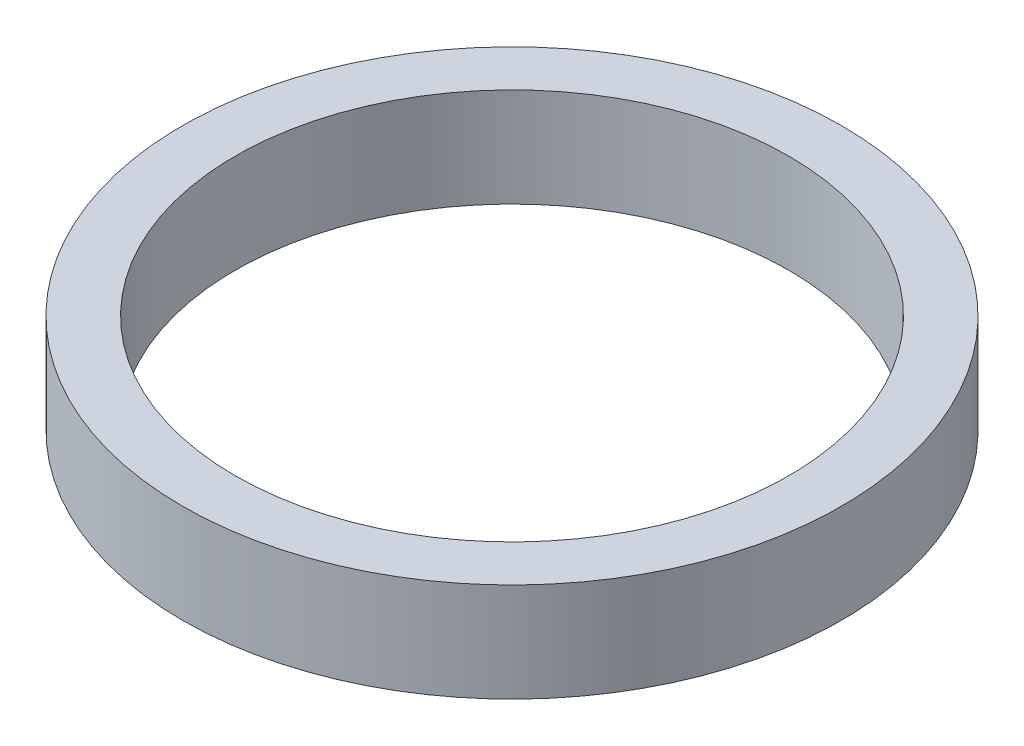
from build123d import *

# Parameters (mm, degrees)
ESQUISSE1_W = 0.8
ESQUISSE1_H = 1.5


with BuildPart() as part:
    # Esquisse1 → Base-R_volution (revolve)
    with BuildSketch(Plane.XY, mode=Mode.PRIVATE) as base_r_volution_sk:
        with Locations((4.6, 0.75)):
            Rectangle(ESQUISSE1_W, ESQUISSE1_H)
    revolve(base_r_volution_sk.sketch.rotate(Axis((0, 0, 0), (0, 1, 0)), 90), axis=Axis((0, 0, 0), (0, 1, 0)))


solid = part.part
